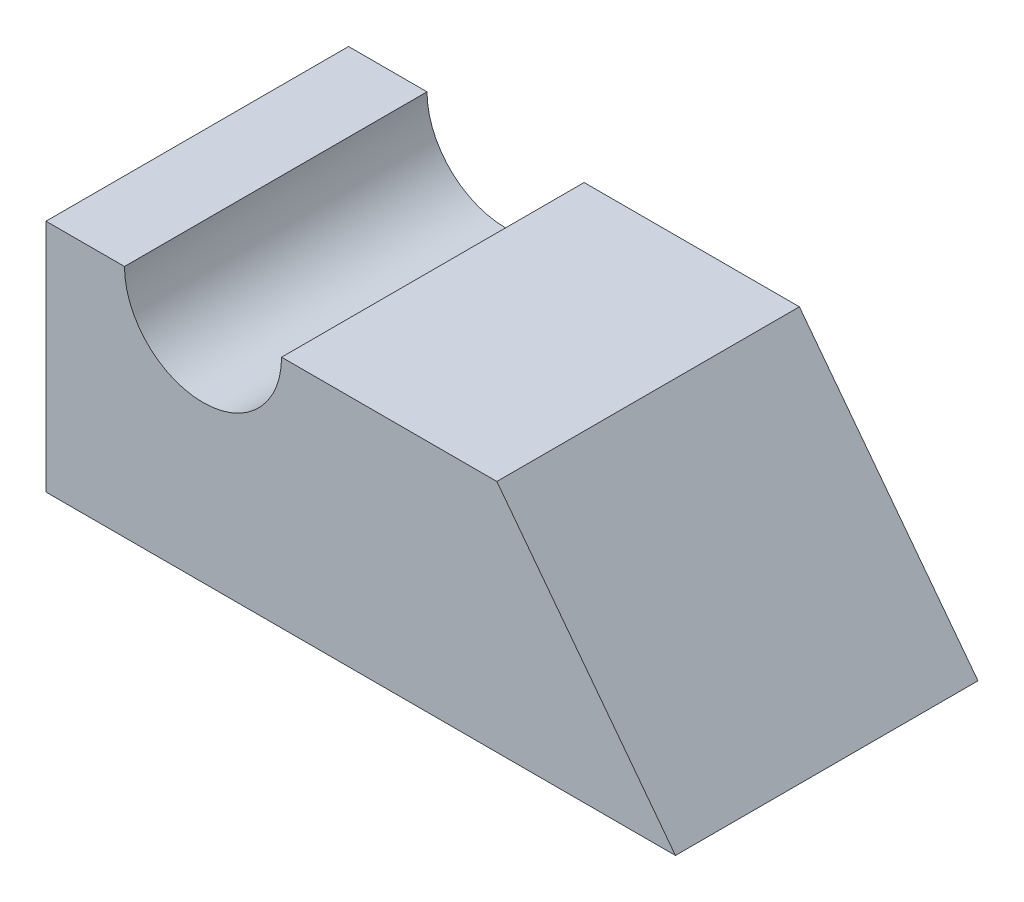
from build123d import *

# Parameters (mm, degrees)
BOSS_EXTRUDE1_DEPTH = 22.86


with BuildPart() as part:
    # Sketch1 → Boss-Extrude1 (new, symmetric)
    with BuildSketch(Plane.XY):
        with BuildLine():
            Line((0, 0), (95.123467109, 0))
            Line((95.123467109, 0), (68.131235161, 35.45481648))
            Line((68.131235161, 35.45481648), (35.599563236, 35.45481648))
            ThreePointArc((35.599563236, 35.45481648), (23.729189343, 23.584442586), (11.858815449, 35.45481648))
            Line((11.858815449, 35.45481648), (0, 35.45481648))
            Line((0, 35.45481648), (0, 0))
        make_face()
    extrude(amount=BOSS_EXTRUDE1_DEPTH, both=True)


solid = part.part
